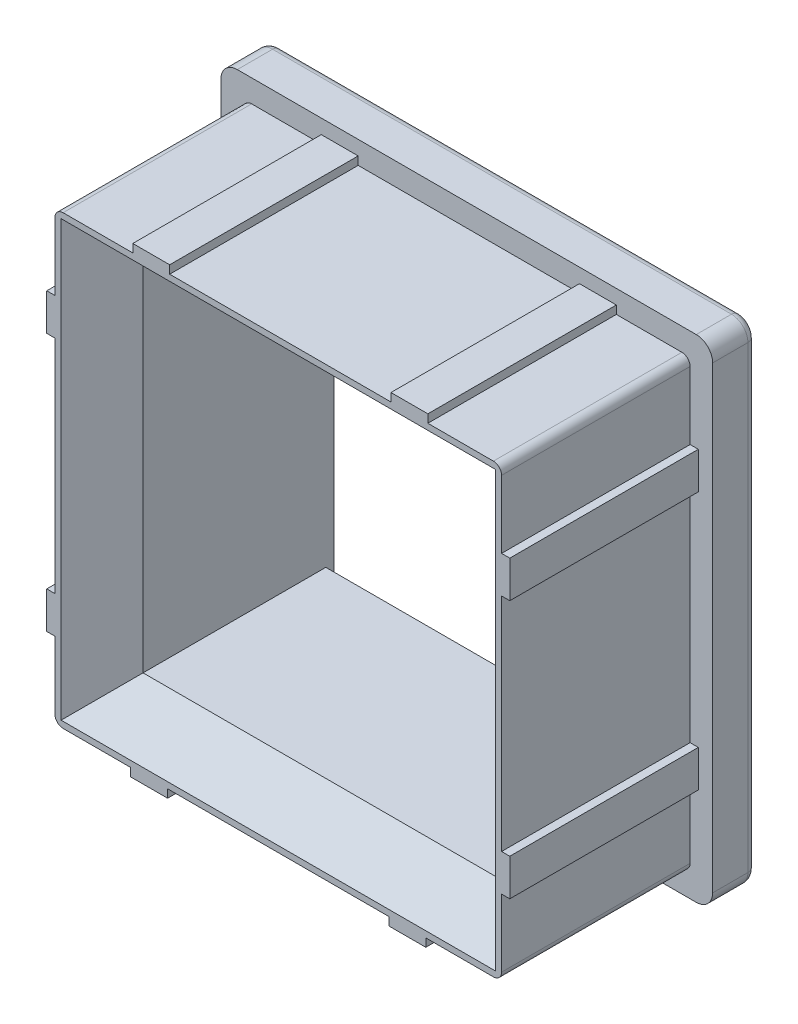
from build123d import *

# Parameters (mm, degrees)
ESQUISSE1_W             = 60
ESQUISSE1_H             = 60
BOSS_EXTRU_1_DEPTH      = 5.3
BOSS_EXTRU_2_DEPTH      = 23
ESQUISSE3_W             = 43
ESQUISSE3_H             = 43
ENL_V_MAT_EXTRU_1_DEPTH = 90.447694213
CONG_1_R                = 2
CONG_2_R                = 2
CONG_3_R                = 2
CONG_4_R                = 2
CHANFREIN1_SIZE         = 1
CHANFREIN2_SIZE         = 5
CONG_5_R                = 1
CONG_6_R                = 1
CONG_7_R                = 1
CONG_8_R                = 1
CONG_9_R                = 1


with BuildPart() as part:
    # Esquisse1 → Boss.-Extru.1 (new body)
    with BuildSketch(Plane.XY.offset(5.3)):
        with Locations((30, 30)):
            Rectangle(ESQUISSE1_W, ESQUISSE1_H)
    extrude(amount=-BOSS_EXTRU_1_DEPTH)

    # Esquisse2 → Boss.-Extru.2 (add)
    with BuildSketch(Plane.XY.offset(5.3)):
        Polygon((58.25, 43.5), (57.25, 43.5), (57.25, 16.5), (58.25, 16.5), (58.25, 12), (57.25, 12), (57.25, 2.75), (48, 2.75), (48, 1.75), (43.5, 1.75), (43.5, 2.75), (16.5, 2.75), (16.5, 1.75), (12, 1.75), (12, 2.75), (2.75, 2.75), (2.75, 12), (1.75, 12), (1.75, 16.5), (2.75, 16.5), (2.75, 43.5), (1.75, 43.5), (1.75, 48), (2.75, 48), (2.75, 57.25), (12.25, 57.25), (12.25, 58.25), (16.75, 58.25), (16.75, 57.25), (43.75, 57.25), (43.75, 58.25), (48.25, 58.25), (48.25, 57.25), (57.25, 57.25), (57.25, 48), (58.25, 48), align=None)
    extrude(amount=BOSS_EXTRU_2_DEPTH)

    # Esquisse3 → Enl_v. mat.-Extru.1 (cut, through all)
    with BuildSketch(Plane(origin=(0, 0, 0), x_dir=(-1, 0, 0), z_dir=(0, 0, -1))):
        with Locations((-30, 30)):
            Rectangle(ESQUISSE3_W, ESQUISSE3_H)
    extrude(amount=-ENL_V_MAT_EXTRU_1_DEPTH, mode=Mode.SUBTRACT)

    # Cong_1
    cong_1_edges = [part.edges().sort_by_distance(p)[0] for p in [
        (0, 60, 2.65),
    ]]
    fillet(cong_1_edges, radius=CONG_1_R)

    # Cong_2
    cong_2_edges = [part.edges().sort_by_distance(p)[0] for p in [
        (60, 0, 2.65),
    ]]
    fillet(cong_2_edges, radius=CONG_2_R)

    # Cong_3
    cong_3_edges = [part.edges().sort_by_distance(p)[0] for p in [
        (60, 60, 2.65),
    ]]
    fillet(cong_3_edges, radius=CONG_3_R)

    # Cong_4
    cong_4_edges = [part.edges().sort_by_distance(p)[0] for p in [
        (0, 0, 2.65),
    ]]
    fillet(cong_4_edges, radius=CONG_4_R)

    # Chanfrein1
    chanfrein1_edges = [part.edges().sort_by_distance(p)[0] for p in [
        (30, 51.5, 0),
        (51.5, 30, 0),
        (30, 8.5, 0),
    ]]
    chamfer(chanfrein1_edges, length=CHANFREIN1_SIZE)

    # Chanfrein2
    chanfrein2_edges = [part.edges().sort_by_distance(p)[0] for p in [
        (30, 51.5, 28.3),
        (8.5, 30, 28.3),
        (30, 8.5, 28.3),
        (51.5, 30, 28.3),
    ]]
    chamfer(chanfrein2_edges, length=CHANFREIN2_SIZE)

    # Cong_5
    cong_5_edges = [part.edges().sort_by_distance(p)[0] for p in [
        (57.25, 2.75, 16.8),
    ]]
    fillet(cong_5_edges, radius=CONG_5_R)

    # Cong_6
    cong_6_edges = [part.edges().sort_by_distance(p)[0] for p in [
        (2.75, 57.25, 16.8),
    ]]
    fillet(cong_6_edges, radius=CONG_6_R)

    # Cong_7
    cong_7_edges = [part.edges().sort_by_distance(p)[0] for p in [
        (2.75, 2.75, 16.8),
    ]]
    fillet(cong_7_edges, radius=CONG_7_R)

    # Cong_8
    cong_8_edges = [part.edges().sort_by_distance(p)[0] for p in [
        (57.25, 57.25, 16.8),
    ]]
    fillet(cong_8_edges, radius=CONG_8_R)

    # Cong_9
    cong_9_edges = [part.edges().sort_by_distance(p)[0] for p in [
        (0, 30, 0),
        (0.585786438, 59.414213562, 0),
        (60, 30, 0),
        (59.414213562, 0.585786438, 0),
        (30, 60, 0),
        (59.414213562, 59.414213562, 0),
        (30, 0, 0),
        (0.585786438, 0.585786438, 0),
    ]]
    fillet(cong_9_edges, radius=CONG_9_R)


solid = part.part
